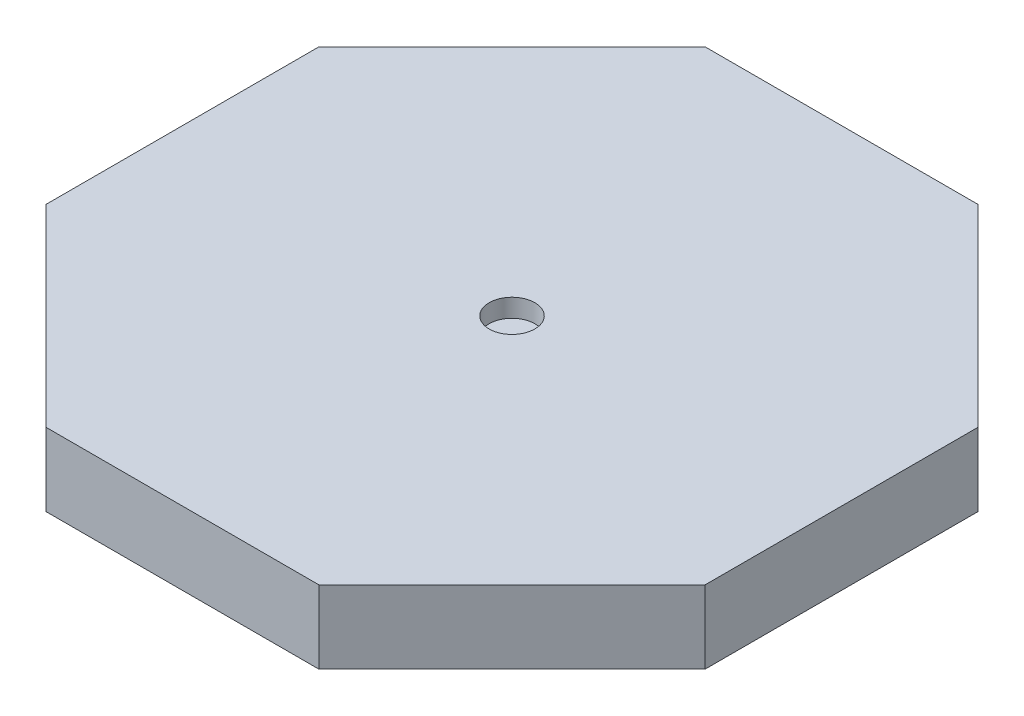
ISO-10303-21;
HEADER;
FILE_DESCRIPTION(('STEP AP214'),'2;1');
FILE_NAME('part.step','',(''),(''),'','','');
FILE_SCHEMA(('AUTOMOTIVE_DESIGN { 1 0 10303 214 1 1 1 1 }'));
ENDSEC;
DATA;
#1=APPLICATION_CONTEXT('core data for automotive mechanical design processes');
#2=APPLICATION_PROTOCOL_DEFINITION('international standard','automotive_design',2000,#1);
#3=PRODUCT_CONTEXT('',#1,'mechanical');
#4=PRODUCT('Part','Part','',(#3));
#5=PRODUCT_RELATED_PRODUCT_CATEGORY('part','',(#4));
#6=PRODUCT_DEFINITION_FORMATION('','',#4);
#7=PRODUCT_DEFINITION_CONTEXT('part definition',#1,'design');
#8=PRODUCT_DEFINITION('design','',#6,#7);
#9=PRODUCT_DEFINITION_SHAPE('','',#8);
#10=(LENGTH_UNIT() NAMED_UNIT(*) SI_UNIT(.MILLI.,.METRE.));
#11=(NAMED_UNIT(*) PLANE_ANGLE_UNIT() SI_UNIT($,.RADIAN.));
#12=(NAMED_UNIT(*) SI_UNIT($,.STERADIAN.) SOLID_ANGLE_UNIT());
#13=UNCERTAINTY_MEASURE_WITH_UNIT(LENGTH_MEASURE(1.E-05),#10,'distance_accuracy_value','');
#14=(GEOMETRIC_REPRESENTATION_CONTEXT(3) GLOBAL_UNCERTAINTY_ASSIGNED_CONTEXT((#13)) GLOBAL_UNIT_ASSIGNED_CONTEXT((#10,
#11,#12)) REPRESENTATION_CONTEXT('',''));
#15=CARTESIAN_POINT('',(0.,0.,0.));
#16=DIRECTION('',(0.,0.,1.));
#17=DIRECTION('',(1.,0.,0.));
#18=AXIS2_PLACEMENT_3D('',#15,#16,#17);
#19=CARTESIAN_POINT('',(36.0924927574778,8.,-14.95));
#20=DIRECTION('',(-0.707106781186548,0.,0.707106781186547));
#21=DIRECTION('',(0.707106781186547,0.,0.707106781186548));
#22=AXIS2_PLACEMENT_3D('',#19,#20,#21);
#23=PLANE('',#22);
#24=DIRECTION('',(-0.707106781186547,0.,-0.707106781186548));
#25=VECTOR('',#24,1.);
#26=CARTESIAN_POINT('',(36.0924927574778,0.,-14.95));
#27=LINE('',#26,#25);
#28=CARTESIAN_POINT('',(36.0924927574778,0.,-14.95));
#29=VERTEX_POINT('',#28);
#30=CARTESIAN_POINT('',(14.95,0.,-36.0924927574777));
#31=VERTEX_POINT('',#30);
#32=EDGE_CURVE('E129',#29,#31,#27,.T.);
#33=ORIENTED_EDGE('',*,*,#32,.T.);
#34=DIRECTION('',(0.,-1.,0.));
#35=VECTOR('',#34,1.);
#36=CARTESIAN_POINT('',(14.95,8.,-36.0924927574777));
#37=LINE('',#36,#35);
#38=CARTESIAN_POINT('',(14.95,8.,-36.0924927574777));
#39=VERTEX_POINT('',#38);
#40=EDGE_CURVE('E11',#39,#31,#37,.T.);
#41=ORIENTED_EDGE('',*,*,#40,.F.);
#42=DIRECTION('',(-0.707106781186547,0.,-0.707106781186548));
#43=VECTOR('',#42,1.);
#44=CARTESIAN_POINT('',(36.0924927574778,8.,-14.95));
#45=LINE('',#44,#43);
#46=CARTESIAN_POINT('',(36.0924927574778,8.,-14.95));
#47=VERTEX_POINT('',#46);
#48=EDGE_CURVE('E144',#47,#39,#45,.T.);
#49=ORIENTED_EDGE('',*,*,#48,.F.);
#50=DIRECTION('',(0.,-1.,0.));
#51=VECTOR('',#50,1.);
#52=CARTESIAN_POINT('',(36.0924927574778,8.,-14.95));
#53=LINE('',#52,#51);
#54=EDGE_CURVE('E125',#47,#29,#53,.T.);
#55=ORIENTED_EDGE('',*,*,#54,.T.);
#56=EDGE_LOOP('',(#33,#41,#49,#55));
#57=FACE_BOUND('',#56,.T.);
#58=ADVANCED_FACE('F33',(#57),#23,.F.);
#59=CARTESIAN_POINT('',(14.95,8.,-36.0924927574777));
#60=DIRECTION('',(0.,0.,1.));
#61=DIRECTION('',(1.,0.,0.));
#62=AXIS2_PLACEMENT_3D('',#59,#60,#61);
#63=PLANE('',#62);
#64=DIRECTION('',(-1.,0.,0.));
#65=VECTOR('',#64,1.);
#66=CARTESIAN_POINT('',(14.95,0.,-36.0924927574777));
#67=LINE('',#66,#65);
#68=CARTESIAN_POINT('',(-14.95,0.,-36.0924927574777));
#69=VERTEX_POINT('',#68);
#70=EDGE_CURVE('E132',#31,#69,#67,.T.);
#71=ORIENTED_EDGE('',*,*,#70,.T.);
#72=DIRECTION('',(0.,-1.,0.));
#73=VECTOR('',#72,1.);
#74=CARTESIAN_POINT('',(-14.95,8.,-36.0924927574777));
#75=LINE('',#74,#73);
#76=CARTESIAN_POINT('',(-14.95,8.,-36.0924927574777));
#77=VERTEX_POINT('',#76);
#78=EDGE_CURVE('E41',#77,#69,#75,.T.);
#79=ORIENTED_EDGE('',*,*,#78,.F.);
#80=DIRECTION('',(-1.,0.,0.));
#81=VECTOR('',#80,1.);
#82=CARTESIAN_POINT('',(14.95,8.,-36.0924927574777));
#83=LINE('',#82,#81);
#84=EDGE_CURVE('E92',#39,#77,#83,.T.);
#85=ORIENTED_EDGE('',*,*,#84,.F.);
#86=ORIENTED_EDGE('',*,*,#40,.T.);
#87=EDGE_LOOP('',(#71,#79,#85,#86));
#88=FACE_BOUND('',#87,.T.);
#89=ADVANCED_FACE('F201',(#88),#63,.F.);
#90=CARTESIAN_POINT('',(-14.95,8.,-36.0924927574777));
#91=DIRECTION('',(0.707106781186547,0.,0.707106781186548));
#92=DIRECTION('',(0.707106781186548,0.,-0.707106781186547));
#93=AXIS2_PLACEMENT_3D('',#90,#91,#92);
#94=PLANE('',#93);
#95=DIRECTION('',(-0.707106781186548,0.,0.707106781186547));
#96=VECTOR('',#95,1.);
#97=CARTESIAN_POINT('',(-14.95,0.,-36.0924927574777));
#98=LINE('',#97,#96);
#99=CARTESIAN_POINT('',(-36.0924927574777,0.,-14.95));
#100=VERTEX_POINT('',#99);
#101=EDGE_CURVE('E135',#69,#100,#98,.T.);
#102=ORIENTED_EDGE('',*,*,#101,.T.);
#103=DIRECTION('',(0.,-1.,0.));
#104=VECTOR('',#103,1.);
#105=CARTESIAN_POINT('',(-36.0924927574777,8.,-14.95));
#106=LINE('',#105,#104);
#107=CARTESIAN_POINT('',(-36.0924927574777,8.,-14.95));
#108=VERTEX_POINT('',#107);
#109=EDGE_CURVE('E151',#108,#100,#106,.T.);
#110=ORIENTED_EDGE('',*,*,#109,.F.);
#111=DIRECTION('',(-0.707106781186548,0.,0.707106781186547));
#112=VECTOR('',#111,1.);
#113=CARTESIAN_POINT('',(-14.95,8.,-36.0924927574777));
#114=LINE('',#113,#112);
#115=EDGE_CURVE('E159',#77,#108,#114,.T.);
#116=ORIENTED_EDGE('',*,*,#115,.F.);
#117=ORIENTED_EDGE('',*,*,#78,.T.);
#118=EDGE_LOOP('',(#102,#110,#116,#117));
#119=FACE_BOUND('',#118,.T.);
#120=ADVANCED_FACE('F157',(#119),#94,.F.);
#121=CARTESIAN_POINT('',(-36.0924927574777,8.,-14.95));
#122=DIRECTION('',(1.,0.,0.));
#123=DIRECTION('',(0.,0.,-1.));
#124=AXIS2_PLACEMENT_3D('',#121,#122,#123);
#125=PLANE('',#124);
#126=DIRECTION('',(0.,0.,1.));
#127=VECTOR('',#126,1.);
#128=CARTESIAN_POINT('',(-36.0924927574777,0.,-14.95));
#129=LINE('',#128,#127);
#130=CARTESIAN_POINT('',(-36.0924927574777,0.,14.95));
#131=VERTEX_POINT('',#130);
#132=EDGE_CURVE('E137',#100,#131,#129,.T.);
#133=ORIENTED_EDGE('',*,*,#132,.T.);
#134=DIRECTION('',(0.,-1.,0.));
#135=VECTOR('',#134,1.);
#136=CARTESIAN_POINT('',(-36.0924927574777,8.,14.95));
#137=LINE('',#136,#135);
#138=CARTESIAN_POINT('',(-36.0924927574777,8.,14.95));
#139=VERTEX_POINT('',#138);
#140=EDGE_CURVE('E148',#139,#131,#137,.T.);
#141=ORIENTED_EDGE('',*,*,#140,.F.);
#142=DIRECTION('',(0.,0.,1.));
#143=VECTOR('',#142,1.);
#144=CARTESIAN_POINT('',(-36.0924927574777,8.,-14.95));
#145=LINE('',#144,#143);
#146=EDGE_CURVE('E171',#108,#139,#145,.T.);
#147=ORIENTED_EDGE('',*,*,#146,.F.);
#148=ORIENTED_EDGE('',*,*,#109,.T.);
#149=EDGE_LOOP('',(#133,#141,#147,#148));
#150=FACE_BOUND('',#149,.T.);
#151=ADVANCED_FACE('F167',(#150),#125,.F.);
#152=CARTESIAN_POINT('',(-36.0924927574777,8.,14.95));
#153=DIRECTION('',(0.707106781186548,0.,-0.707106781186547));
#154=DIRECTION('',(-0.707106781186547,0.,-0.707106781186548));
#155=AXIS2_PLACEMENT_3D('',#152,#153,#154);
#156=PLANE('',#155);
#157=DIRECTION('',(0.707106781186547,0.,0.707106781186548));
#158=VECTOR('',#157,1.);
#159=CARTESIAN_POINT('',(-36.0924927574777,0.,14.95));
#160=LINE('',#159,#158);
#161=CARTESIAN_POINT('',(-14.95,0.,36.0924927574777));
#162=VERTEX_POINT('',#161);
#163=EDGE_CURVE('E139',#131,#162,#160,.T.);
#164=ORIENTED_EDGE('',*,*,#163,.T.);
#165=DIRECTION('',(0.,-1.,0.));
#166=VECTOR('',#165,1.);
#167=CARTESIAN_POINT('',(-14.95,8.,36.0924927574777));
#168=LINE('',#167,#166);
#169=CARTESIAN_POINT('',(-14.95,8.,36.0924927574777));
#170=VERTEX_POINT('',#169);
#171=EDGE_CURVE('E120',#170,#162,#168,.T.);
#172=ORIENTED_EDGE('',*,*,#171,.F.);
#173=DIRECTION('',(0.707106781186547,0.,0.707106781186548));
#174=VECTOR('',#173,1.);
#175=CARTESIAN_POINT('',(-36.0924927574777,8.,14.95));
#176=LINE('',#175,#174);
#177=EDGE_CURVE('E111',#139,#170,#176,.T.);
#178=ORIENTED_EDGE('',*,*,#177,.F.);
#179=ORIENTED_EDGE('',*,*,#140,.T.);
#180=EDGE_LOOP('',(#164,#172,#178,#179));
#181=FACE_BOUND('',#180,.T.);
#182=ADVANCED_FACE('F170',(#181),#156,.F.);
#183=CARTESIAN_POINT('',(-14.95,8.,36.0924927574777));
#184=DIRECTION('',(0.,0.,-1.));
#185=DIRECTION('',(-1.,0.,0.));
#186=AXIS2_PLACEMENT_3D('',#183,#184,#185);
#187=PLANE('',#186);
#188=DIRECTION('',(1.,0.,0.));
#189=VECTOR('',#188,1.);
#190=CARTESIAN_POINT('',(-14.95,0.,36.0924927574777));
#191=LINE('',#190,#189);
#192=CARTESIAN_POINT('',(14.95,0.,36.0924927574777));
#193=VERTEX_POINT('',#192);
#194=EDGE_CURVE('E119',#162,#193,#191,.T.);
#195=ORIENTED_EDGE('',*,*,#194,.T.);
#196=DIRECTION('',(0.,-1.,0.));
#197=VECTOR('',#196,1.);
#198=CARTESIAN_POINT('',(14.95,8.,36.0924927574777));
#199=LINE('',#198,#197);
#200=CARTESIAN_POINT('',(14.95,8.,36.0924927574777));
#201=VERTEX_POINT('',#200);
#202=EDGE_CURVE('E116',#201,#193,#199,.T.);
#203=ORIENTED_EDGE('',*,*,#202,.F.);
#204=DIRECTION('',(1.,0.,0.));
#205=VECTOR('',#204,1.);
#206=CARTESIAN_POINT('',(-14.95,8.,36.0924927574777));
#207=LINE('',#206,#205);
#208=EDGE_CURVE('E105',#170,#201,#207,.T.);
#209=ORIENTED_EDGE('',*,*,#208,.F.);
#210=ORIENTED_EDGE('',*,*,#171,.T.);
#211=EDGE_LOOP('',(#195,#203,#209,#210));
#212=FACE_BOUND('',#211,.T.);
#213=ADVANCED_FACE('F117',(#212),#187,.F.);
#214=CARTESIAN_POINT('',(14.95,8.,36.0924927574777));
#215=DIRECTION('',(-0.707106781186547,0.,-0.707106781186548));
#216=DIRECTION('',(-0.707106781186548,0.,0.707106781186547));
#217=AXIS2_PLACEMENT_3D('',#214,#215,#216);
#218=PLANE('',#217);
#219=DIRECTION('',(0.707106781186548,0.,-0.707106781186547));
#220=VECTOR('',#219,1.);
#221=CARTESIAN_POINT('',(14.95,0.,36.0924927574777));
#222=LINE('',#221,#220);
#223=CARTESIAN_POINT('',(36.0924927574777,0.,14.95));
#224=VERTEX_POINT('',#223);
#225=EDGE_CURVE('E78',#193,#224,#222,.T.);
#226=ORIENTED_EDGE('',*,*,#225,.T.);
#227=DIRECTION('',(0.,-1.,0.));
#228=VECTOR('',#227,1.);
#229=CARTESIAN_POINT('',(36.0924927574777,8.,14.95));
#230=LINE('',#229,#228);
#231=CARTESIAN_POINT('',(36.0924927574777,8.,14.95));
#232=VERTEX_POINT('',#231);
#233=EDGE_CURVE('E121',#232,#224,#230,.T.);
#234=ORIENTED_EDGE('',*,*,#233,.F.);
#235=DIRECTION('',(0.707106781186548,0.,-0.707106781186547));
#236=VECTOR('',#235,1.);
#237=CARTESIAN_POINT('',(14.95,8.,36.0924927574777));
#238=LINE('',#237,#236);
#239=EDGE_CURVE('E109',#201,#232,#238,.T.);
#240=ORIENTED_EDGE('',*,*,#239,.F.);
#241=ORIENTED_EDGE('',*,*,#202,.T.);
#242=EDGE_LOOP('',(#226,#234,#240,#241));
#243=FACE_BOUND('',#242,.T.);
#244=ADVANCED_FACE('F123',(#243),#218,.F.);
#245=CARTESIAN_POINT('',(36.0924927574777,8.,14.95));
#246=DIRECTION('',(-1.,0.,0.));
#247=DIRECTION('',(0.,0.,1.));
#248=AXIS2_PLACEMENT_3D('',#245,#246,#247);
#249=PLANE('',#248);
#250=DIRECTION('',(0.,0.,-1.));
#251=VECTOR('',#250,1.);
#252=CARTESIAN_POINT('',(36.0924927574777,0.,14.95));
#253=LINE('',#252,#251);
#254=EDGE_CURVE('E84',#224,#29,#253,.T.);
#255=ORIENTED_EDGE('',*,*,#254,.T.);
#256=ORIENTED_EDGE('',*,*,#54,.F.);
#257=DIRECTION('',(0.,0.,-1.));
#258=VECTOR('',#257,1.);
#259=CARTESIAN_POINT('',(36.0924927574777,8.,14.95));
#260=LINE('',#259,#258);
#261=EDGE_CURVE('E49',#232,#47,#260,.T.);
#262=ORIENTED_EDGE('',*,*,#261,.F.);
#263=ORIENTED_EDGE('',*,*,#233,.T.);
#264=EDGE_LOOP('',(#255,#256,#262,#263));
#265=FACE_BOUND('',#264,.T.);
#266=ADVANCED_FACE('F192',(#265),#249,.F.);
#267=CARTESIAN_POINT('',(0.,8.,0.));
#268=DIRECTION('',(0.,1.,0.));
#269=DIRECTION('',(0.,0.,1.));
#270=AXIS2_PLACEMENT_3D('',#267,#268,#269);
#271=PLANE('',#270);
#272=CARTESIAN_POINT('',(0.,8.,0.));
#273=DIRECTION('',(0.,1.,0.));
#274=DIRECTION('',(0.,0.,1.));
#275=AXIS2_PLACEMENT_3D('',#272,#273,#274);
#276=CIRCLE('',#275,2.5);
#277=CARTESIAN_POINT('',(0.,8.,2.5));
#278=VERTEX_POINT('',#277);
#279=EDGE_CURVE('E177',#278,#278,#276,.T.);
#280=ORIENTED_EDGE('',*,*,#279,.F.);
#281=EDGE_LOOP('',(#280));
#282=FACE_BOUND('',#281,.T.);
#283=ORIENTED_EDGE('',*,*,#48,.T.);
#284=ORIENTED_EDGE('',*,*,#84,.T.);
#285=ORIENTED_EDGE('',*,*,#115,.T.);
#286=ORIENTED_EDGE('',*,*,#146,.T.);
#287=ORIENTED_EDGE('',*,*,#177,.T.);
#288=ORIENTED_EDGE('',*,*,#208,.T.);
#289=ORIENTED_EDGE('',*,*,#239,.T.);
#290=ORIENTED_EDGE('',*,*,#261,.T.);
#291=EDGE_LOOP('',(#283,#284,#285,#286,#287,#288,#289,#290));
#292=FACE_BOUND('',#291,.T.);
#293=ADVANCED_FACE('F107',(#282,#292),#271,.T.);
#294=CARTESIAN_POINT('',(0.,0.,0.));
#295=DIRECTION('',(0.,1.,0.));
#296=DIRECTION('',(0.,0.,1.));
#297=AXIS2_PLACEMENT_3D('',#294,#295,#296);
#298=PLANE('',#297);
#299=ORIENTED_EDGE('',*,*,#32,.F.);
#300=ORIENTED_EDGE('',*,*,#254,.F.);
#301=ORIENTED_EDGE('',*,*,#225,.F.);
#302=ORIENTED_EDGE('',*,*,#194,.F.);
#303=ORIENTED_EDGE('',*,*,#163,.F.);
#304=ORIENTED_EDGE('',*,*,#132,.F.);
#305=ORIENTED_EDGE('',*,*,#101,.F.);
#306=ORIENTED_EDGE('',*,*,#70,.F.);
#307=EDGE_LOOP('',(#299,#300,#301,#302,#303,#304,#305,#306));
#308=FACE_BOUND('',#307,.T.);
#309=ADVANCED_FACE('F163',(#308),#298,.F.);
#310=CARTESIAN_POINT('',(0.,6.,0.));
#311=DIRECTION('',(0.,1.,0.));
#312=DIRECTION('',(0.,0.,1.));
#313=AXIS2_PLACEMENT_3D('',#310,#311,#312);
#314=CYLINDRICAL_SURFACE('',#313,2.5);
#315=CARTESIAN_POINT('',(0.,6.,0.));
#316=DIRECTION('',(0.,1.,0.));
#317=DIRECTION('',(0.,0.,1.));
#318=AXIS2_PLACEMENT_3D('',#315,#316,#317);
#319=CIRCLE('',#318,2.5);
#320=CARTESIAN_POINT('',(0.,6.,2.5));
#321=VERTEX_POINT('',#320);
#322=EDGE_CURVE('E133',#321,#321,#319,.T.);
#323=ORIENTED_EDGE('',*,*,#322,.F.);
#324=EDGE_LOOP('',(#323));
#325=FACE_BOUND('',#324,.T.);
#326=ORIENTED_EDGE('',*,*,#279,.T.);
#327=EDGE_LOOP('',(#326));
#328=FACE_BOUND('',#327,.T.);
#329=ADVANCED_FACE('F185',(#325,#328),#314,.F.);
#330=CARTESIAN_POINT('',(0.,6.,0.));
#331=DIRECTION('',(0.,1.,0.));
#332=DIRECTION('',(0.,0.,1.));
#333=AXIS2_PLACEMENT_3D('',#330,#331,#332);
#334=PLANE('',#333);
#335=ORIENTED_EDGE('',*,*,#322,.T.);
#336=EDGE_LOOP('',(#335));
#337=FACE_BOUND('',#336,.T.);
#338=ADVANCED_FACE('F183',(#337),#334,.T.);
#339=CLOSED_SHELL('',(#58,#89,#120,#151,#182,#213,#244,#266,#293,#309,#329,#338));
#340=MANIFOLD_SOLID_BREP('B2',#339);
#341=ADVANCED_BREP_SHAPE_REPRESENTATION('',(#18,#340),#14);
#342=SHAPE_DEFINITION_REPRESENTATION(#9,#341);
ENDSEC;
END-ISO-10303-21;
